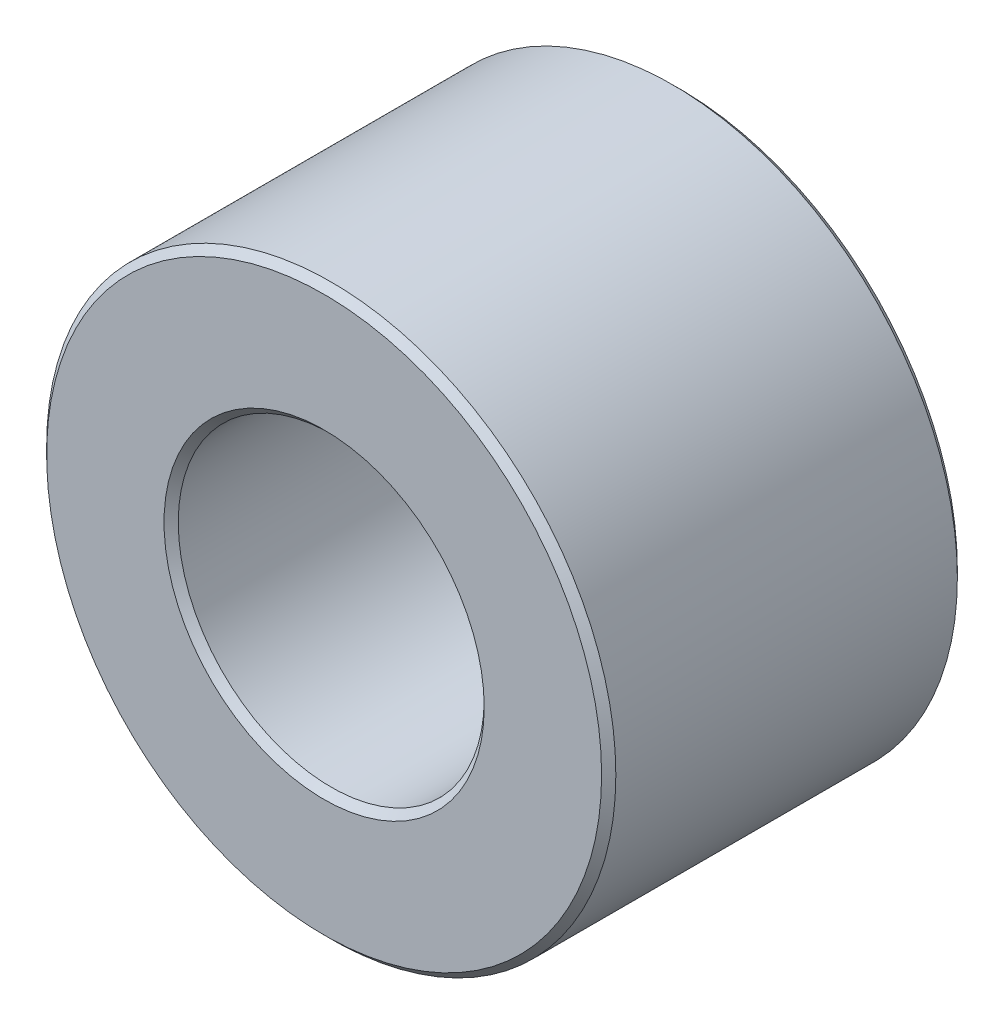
ISO-10303-21;
HEADER;
FILE_DESCRIPTION(('STEP AP214'),'2;1');
FILE_NAME('part.step','',(''),(''),'','','');
FILE_SCHEMA(('AUTOMOTIVE_DESIGN { 1 0 10303 214 1 1 1 1 }'));
ENDSEC;
DATA;
#1=APPLICATION_CONTEXT('core data for automotive mechanical design processes');
#2=APPLICATION_PROTOCOL_DEFINITION('international standard','automotive_design',2000,#1);
#3=PRODUCT_CONTEXT('',#1,'mechanical');
#4=PRODUCT('Part','Part','',(#3));
#5=PRODUCT_RELATED_PRODUCT_CATEGORY('part','',(#4));
#6=PRODUCT_DEFINITION_FORMATION('','',#4);
#7=PRODUCT_DEFINITION_CONTEXT('part definition',#1,'design');
#8=PRODUCT_DEFINITION('design','',#6,#7);
#9=PRODUCT_DEFINITION_SHAPE('','',#8);
#10=(LENGTH_UNIT() NAMED_UNIT(*) SI_UNIT(.MILLI.,.METRE.));
#11=(NAMED_UNIT(*) PLANE_ANGLE_UNIT() SI_UNIT($,.RADIAN.));
#12=(NAMED_UNIT(*) SI_UNIT($,.STERADIAN.) SOLID_ANGLE_UNIT());
#13=UNCERTAINTY_MEASURE_WITH_UNIT(LENGTH_MEASURE(1.E-05),#10,'distance_accuracy_value','');
#14=(GEOMETRIC_REPRESENTATION_CONTEXT(3) GLOBAL_UNCERTAINTY_ASSIGNED_CONTEXT((#13)) GLOBAL_UNIT_ASSIGNED_CONTEXT((#10,
#11,#12)) REPRESENTATION_CONTEXT('',''));
#15=CARTESIAN_POINT('',(0.,0.,0.));
#16=DIRECTION('',(0.,0.,1.));
#17=DIRECTION('',(1.,0.,0.));
#18=AXIS2_PLACEMENT_3D('',#15,#16,#17);
#19=CARTESIAN_POINT('',(0.,0.,2.5));
#20=DIRECTION('',(0.,0.,1.));
#21=DIRECTION('',(1.,0.,0.));
#22=AXIS2_PLACEMENT_3D('',#19,#20,#21);
#23=PLANE('',#22);
#24=CARTESIAN_POINT('',(0.,0.,2.5));
#25=DIRECTION('',(0.,0.,1.));
#26=DIRECTION('',(1.,0.,0.));
#27=AXIS2_PLACEMENT_3D('',#24,#25,#26);
#28=CIRCLE('',#27,2.25);
#29=CARTESIAN_POINT('',(2.25,0.,2.5));
#30=VERTEX_POINT('',#29);
#31=EDGE_CURVE('E10',#30,#30,#28,.F.);
#32=ORIENTED_EDGE('',*,*,#31,.T.);
#33=EDGE_LOOP('',(#32));
#34=FACE_BOUND('',#33,.T.);
#35=CARTESIAN_POINT('',(0.,0.,2.5));
#36=DIRECTION('',(0.,0.,1.));
#37=DIRECTION('',(1.,0.,0.));
#38=AXIS2_PLACEMENT_3D('',#35,#36,#37);
#39=CIRCLE('',#38,3.9);
#40=CARTESIAN_POINT('',(3.9,0.,2.5));
#41=VERTEX_POINT('',#40);
#42=EDGE_CURVE('E45',#41,#41,#39,.T.);
#43=ORIENTED_EDGE('',*,*,#42,.T.);
#44=EDGE_LOOP('',(#43));
#45=FACE_BOUND('',#44,.T.);
#46=ADVANCED_FACE('F37',(#34,#45),#23,.T.);
#47=CARTESIAN_POINT('',(0.,0.,-2.5));
#48=DIRECTION('',(0.,0.,1.));
#49=DIRECTION('',(1.,0.,0.));
#50=AXIS2_PLACEMENT_3D('',#47,#48,#49);
#51=PLANE('',#50);
#52=CARTESIAN_POINT('',(0.,0.,-2.5));
#53=DIRECTION('',(0.,0.,1.));
#54=DIRECTION('',(1.,0.,0.));
#55=AXIS2_PLACEMENT_3D('',#52,#53,#54);
#56=CIRCLE('',#55,3.9);
#57=CARTESIAN_POINT('',(3.9,0.,-2.5));
#58=VERTEX_POINT('',#57);
#59=EDGE_CURVE('E64',#58,#58,#56,.F.);
#60=ORIENTED_EDGE('',*,*,#59,.T.);
#61=EDGE_LOOP('',(#60));
#62=FACE_BOUND('',#61,.T.);
#63=CARTESIAN_POINT('',(0.,0.,-2.5));
#64=DIRECTION('',(0.,0.,1.));
#65=DIRECTION('',(1.,0.,0.));
#66=AXIS2_PLACEMENT_3D('',#63,#64,#65);
#67=CIRCLE('',#66,2.25);
#68=CARTESIAN_POINT('',(2.25,0.,-2.5));
#69=VERTEX_POINT('',#68);
#70=EDGE_CURVE('E67',#69,#69,#67,.T.);
#71=ORIENTED_EDGE('',*,*,#70,.T.);
#72=EDGE_LOOP('',(#71));
#73=FACE_BOUND('',#72,.T.);
#74=ADVANCED_FACE('F89',(#62,#73),#51,.F.);
#75=CARTESIAN_POINT('',(0.,0.,2.5));
#76=DIRECTION('',(0.,0.,-1.));
#77=DIRECTION('',(-1.,0.,0.));
#78=AXIS2_PLACEMENT_3D('',#75,#76,#77);
#79=CYLINDRICAL_SURFACE('',#78,4.);
#80=CARTESIAN_POINT('',(0.,0.,-2.4));
#81=DIRECTION('',(0.,0.,1.));
#82=DIRECTION('',(1.,0.,0.));
#83=AXIS2_PLACEMENT_3D('',#80,#81,#82);
#84=CIRCLE('',#83,4.);
#85=CARTESIAN_POINT('',(4.,0.,-2.4));
#86=VERTEX_POINT('',#85);
#87=EDGE_CURVE('E70',#86,#86,#84,.T.);
#88=ORIENTED_EDGE('',*,*,#87,.T.);
#89=EDGE_LOOP('',(#88));
#90=FACE_BOUND('',#89,.T.);
#91=CARTESIAN_POINT('',(0.,0.,2.4));
#92=DIRECTION('',(0.,0.,1.));
#93=DIRECTION('',(1.,0.,0.));
#94=AXIS2_PLACEMENT_3D('',#91,#92,#93);
#95=CIRCLE('',#94,4.);
#96=CARTESIAN_POINT('',(4.,0.,2.4));
#97=VERTEX_POINT('',#96);
#98=EDGE_CURVE('E73',#97,#97,#95,.F.);
#99=ORIENTED_EDGE('',*,*,#98,.T.);
#100=EDGE_LOOP('',(#99));
#101=FACE_BOUND('',#100,.T.);
#102=ADVANCED_FACE('F78',(#90,#101),#79,.T.);
#103=CARTESIAN_POINT('',(0.,0.,2.5));
#104=DIRECTION('',(0.,0.,-1.));
#105=DIRECTION('',(-1.,0.,0.));
#106=AXIS2_PLACEMENT_3D('',#103,#104,#105);
#107=CYLINDRICAL_SURFACE('',#106,2.15);
#108=CARTESIAN_POINT('',(0.,0.,-2.4));
#109=DIRECTION('',(0.,0.,1.));
#110=DIRECTION('',(1.,0.,0.));
#111=AXIS2_PLACEMENT_3D('',#108,#109,#110);
#112=CIRCLE('',#111,2.15);
#113=CARTESIAN_POINT('',(2.15,0.,-2.4));
#114=VERTEX_POINT('',#113);
#115=EDGE_CURVE('E52',#114,#114,#112,.F.);
#116=ORIENTED_EDGE('',*,*,#115,.T.);
#117=EDGE_LOOP('',(#116));
#118=FACE_BOUND('',#117,.T.);
#119=CARTESIAN_POINT('',(0.,0.,2.4));
#120=DIRECTION('',(0.,0.,1.));
#121=DIRECTION('',(1.,0.,0.));
#122=AXIS2_PLACEMENT_3D('',#119,#120,#121);
#123=CIRCLE('',#122,2.15);
#124=CARTESIAN_POINT('',(2.15,0.,2.4));
#125=VERTEX_POINT('',#124);
#126=EDGE_CURVE('E58',#125,#125,#123,.T.);
#127=ORIENTED_EDGE('',*,*,#126,.T.);
#128=EDGE_LOOP('',(#127));
#129=FACE_BOUND('',#128,.T.);
#130=ADVANCED_FACE('F97',(#118,#129),#107,.F.);
#131=CARTESIAN_POINT('',(0.,0.,-2.4));
#132=DIRECTION('',(0.,0.,1.));
#133=DIRECTION('',(1.,0.,0.));
#134=AXIS2_PLACEMENT_3D('',#131,#132,#133);
#135=CONICAL_SURFACE('',#134,4.,0.785398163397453);
#136=CARTESIAN_POINT('',(3.9,0.,-2.5));
#137=CARTESIAN_POINT('',(3.90104166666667,0.,-2.49895833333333));
#138=CARTESIAN_POINT('',(3.90208333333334,0.,-2.49791666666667));
#139=CARTESIAN_POINT('',(3.90416666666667,0.,-2.49583333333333));
#140=CARTESIAN_POINT('',(3.90520833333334,0.,-2.49479166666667));
#141=CARTESIAN_POINT('',(3.90729166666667,0.,-2.49270833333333));
#142=CARTESIAN_POINT('',(3.90833333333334,0.,-2.49166666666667));
#143=CARTESIAN_POINT('',(3.91041666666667,0.,-2.48958333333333));
#144=CARTESIAN_POINT('',(3.91145833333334,0.,-2.48854166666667));
#145=CARTESIAN_POINT('',(3.91354166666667,0.,-2.48645833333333));
#146=CARTESIAN_POINT('',(3.91458333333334,0.,-2.48541666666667));
#147=CARTESIAN_POINT('',(3.91666666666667,0.,-2.48333333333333));
#148=CARTESIAN_POINT('',(3.91770833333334,0.,-2.48229166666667));
#149=CARTESIAN_POINT('',(3.91979166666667,0.,-2.48020833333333));
#150=CARTESIAN_POINT('',(3.92083333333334,0.,-2.47916666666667));
#151=CARTESIAN_POINT('',(3.92291666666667,0.,-2.47708333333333));
#152=CARTESIAN_POINT('',(3.92395833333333,0.,-2.47604166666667));
#153=CARTESIAN_POINT('',(3.92604166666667,0.,-2.47395833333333));
#154=CARTESIAN_POINT('',(3.92708333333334,0.,-2.47291666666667));
#155=CARTESIAN_POINT('',(3.92916666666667,0.,-2.47083333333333));
#156=CARTESIAN_POINT('',(3.93020833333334,0.,-2.46979166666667));
#157=CARTESIAN_POINT('',(3.93229166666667,0.,-2.46770833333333));
#158=CARTESIAN_POINT('',(3.93333333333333,0.,-2.46666666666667));
#159=CARTESIAN_POINT('',(3.93541666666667,0.,-2.46458333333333));
#160=CARTESIAN_POINT('',(3.93645833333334,0.,-2.46354166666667));
#161=CARTESIAN_POINT('',(3.93854166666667,0.,-2.46145833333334));
#162=CARTESIAN_POINT('',(3.93958333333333,0.,-2.46041666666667));
#163=CARTESIAN_POINT('',(3.94166666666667,0.,-2.45833333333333));
#164=CARTESIAN_POINT('',(3.94270833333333,0.,-2.45729166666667));
#165=CARTESIAN_POINT('',(3.94479166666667,0.,-2.45520833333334));
#166=CARTESIAN_POINT('',(3.94583333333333,0.,-2.45416666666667));
#167=CARTESIAN_POINT('',(3.94791666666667,0.,-2.45208333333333));
#168=CARTESIAN_POINT('',(3.94895833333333,0.,-2.45104166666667));
#169=CARTESIAN_POINT('',(3.95104166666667,0.,-2.44895833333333));
#170=CARTESIAN_POINT('',(3.95208333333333,0.,-2.44791666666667));
#171=CARTESIAN_POINT('',(3.95416666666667,0.,-2.44583333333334));
#172=CARTESIAN_POINT('',(3.95520833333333,0.,-2.44479166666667));
#173=CARTESIAN_POINT('',(3.95729166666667,0.,-2.44270833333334));
#174=CARTESIAN_POINT('',(3.95833333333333,0.,-2.44166666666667));
#175=CARTESIAN_POINT('',(3.96041666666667,0.,-2.43958333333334));
#176=CARTESIAN_POINT('',(3.96145833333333,0.,-2.43854166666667));
#177=CARTESIAN_POINT('',(3.96354166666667,0.,-2.43645833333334));
#178=CARTESIAN_POINT('',(3.96458333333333,0.,-2.43541666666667));
#179=CARTESIAN_POINT('',(3.96666666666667,0.,-2.43333333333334));
#180=CARTESIAN_POINT('',(3.96770833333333,0.,-2.43229166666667));
#181=CARTESIAN_POINT('',(3.96979166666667,0.,-2.43020833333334));
#182=CARTESIAN_POINT('',(3.97083333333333,0.,-2.42916666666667));
#183=CARTESIAN_POINT('',(3.97291666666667,0.,-2.42708333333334));
#184=CARTESIAN_POINT('',(3.97395833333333,0.,-2.42604166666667));
#185=CARTESIAN_POINT('',(3.97604166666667,0.,-2.42395833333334));
#186=CARTESIAN_POINT('',(3.97708333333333,0.,-2.42291666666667));
#187=CARTESIAN_POINT('',(3.97916666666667,0.,-2.42083333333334));
#188=CARTESIAN_POINT('',(3.98020833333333,0.,-2.41979166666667));
#189=CARTESIAN_POINT('',(3.98229166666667,0.,-2.41770833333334));
#190=CARTESIAN_POINT('',(3.98333333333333,0.,-2.41666666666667));
#191=CARTESIAN_POINT('',(3.98541666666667,0.,-2.41458333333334));
#192=CARTESIAN_POINT('',(3.98645833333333,0.,-2.41354166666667));
#193=CARTESIAN_POINT('',(3.98854166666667,0.,-2.41145833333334));
#194=CARTESIAN_POINT('',(3.98958333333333,0.,-2.41041666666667));
#195=CARTESIAN_POINT('',(3.99166666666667,0.,-2.40833333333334));
#196=CARTESIAN_POINT('',(3.99270833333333,0.,-2.40729166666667));
#197=CARTESIAN_POINT('',(3.99479166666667,0.,-2.40520833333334));
#198=CARTESIAN_POINT('',(3.99583333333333,0.,-2.40416666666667));
#199=CARTESIAN_POINT('',(3.99791666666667,0.,-2.40208333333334));
#200=CARTESIAN_POINT('',(3.99895833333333,0.,-2.40104166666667));
#201=CARTESIAN_POINT('',(4.,0.,-2.4));
#202=B_SPLINE_CURVE_WITH_KNOTS('',3,(#136,#137,#138,#139,#140,#141,#142,#143,#144,#145,#146,
#147,#148,#149,#150,#151,#152,#153,#154,#155,#156,#157,#158,#159,#160,#161,#162,#163,#164,#165,
#166,#167,#168,#169,#170,#171,#172,#173,#174,#175,#176,#177,#178,#179,#180,#181,#182,#183,#184,
#185,#186,#187,#188,#189,#190,#191,#192,#193,#194,#195,#196,#197,#198,#199,#200,#201),
.UNSPECIFIED.,.F.,.F.,(4,2,2,2,2,2,2,2,2,2,2,2,2,2,2,2,2,2,2,2,2,2,2,2,2,2,2,2,2,2,2,2,4),(0.,
0.00441941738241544,0.00883883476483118,0.0132582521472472,0.017677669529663,0.0220970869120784,
0.0265165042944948,0.0309359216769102,0.0353553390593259,0.0397747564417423,0.0441941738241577,
0.0486135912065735,0.0530330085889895,0.0574524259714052,0.0618718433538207,0.0662912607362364,
0.0707106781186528,0.0751300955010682,0.079549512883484,0.0839689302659,0.0883883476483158,
0.0928077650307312,0.0972271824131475,0.101646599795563,0.106066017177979,0.110485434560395,
0.114904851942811,0.119324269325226,0.123743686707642,0.128163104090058,0.132582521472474,
0.137001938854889,0.141421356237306),.UNSPECIFIED.);
#203=EDGE_CURVE('BSEAM102',#58,#86,#202,.T.);
#204=ORIENTED_EDGE('',*,*,#59,.F.);
#205=ORIENTED_EDGE('',*,*,#87,.F.);
#206=ORIENTED_EDGE('',*,*,#203,.T.);
#207=ORIENTED_EDGE('',*,*,#203,.F.);
#208=EDGE_LOOP('',(#204,#206,#205,#207));
#209=FACE_BOUND('',#208,.T.);
#210=ADVANCED_FACE('F102',(#209),#135,.T.);
#211=CARTESIAN_POINT('',(0.,0.,-2.5));
#212=DIRECTION('',(0.,0.,-1.));
#213=DIRECTION('',(-1.,0.,0.));
#214=AXIS2_PLACEMENT_3D('',#211,#212,#213);
#215=CONICAL_SURFACE('',#214,2.25,0.785398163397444);
#216=ORIENTED_EDGE('',*,*,#115,.F.);
#217=EDGE_LOOP('',(#216));
#218=FACE_BOUND('',#217,.T.);
#219=ORIENTED_EDGE('',*,*,#70,.F.);
#220=EDGE_LOOP('',(#219));
#221=FACE_BOUND('',#220,.T.);
#222=ADVANCED_FACE('F86',(#218,#221),#215,.F.);
#223=CARTESIAN_POINT('',(0.,0.,2.4));
#224=DIRECTION('',(0.,0.,1.));
#225=DIRECTION('',(1.,0.,0.));
#226=AXIS2_PLACEMENT_3D('',#223,#224,#225);
#227=CONICAL_SURFACE('',#226,2.15,0.78539816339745);
#228=ORIENTED_EDGE('',*,*,#31,.F.);
#229=EDGE_LOOP('',(#228));
#230=FACE_BOUND('',#229,.T.);
#231=ORIENTED_EDGE('',*,*,#126,.F.);
#232=EDGE_LOOP('',(#231));
#233=FACE_BOUND('',#232,.T.);
#234=ADVANCED_FACE('F82',(#230,#233),#227,.F.);
#235=CARTESIAN_POINT('',(0.,0.,2.5));
#236=DIRECTION('',(0.,0.,-1.));
#237=DIRECTION('',(-1.,0.,0.));
#238=AXIS2_PLACEMENT_3D('',#235,#236,#237);
#239=CONICAL_SURFACE('',#238,3.9,0.785398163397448);
#240=ORIENTED_EDGE('',*,*,#98,.F.);
#241=EDGE_LOOP('',(#240));
#242=FACE_BOUND('',#241,.T.);
#243=ORIENTED_EDGE('',*,*,#42,.F.);
#244=EDGE_LOOP('',(#243));
#245=FACE_BOUND('',#244,.T.);
#246=ADVANCED_FACE('F39',(#242,#245),#239,.T.);
#247=CLOSED_SHELL('',(#46,#74,#102,#130,#210,#222,#234,#246));
#248=MANIFOLD_SOLID_BREP('B2',#247);
#249=ADVANCED_BREP_SHAPE_REPRESENTATION('',(#18,#248),#14);
#250=SHAPE_DEFINITION_REPRESENTATION(#9,#249);
ENDSEC;
END-ISO-10303-21;
